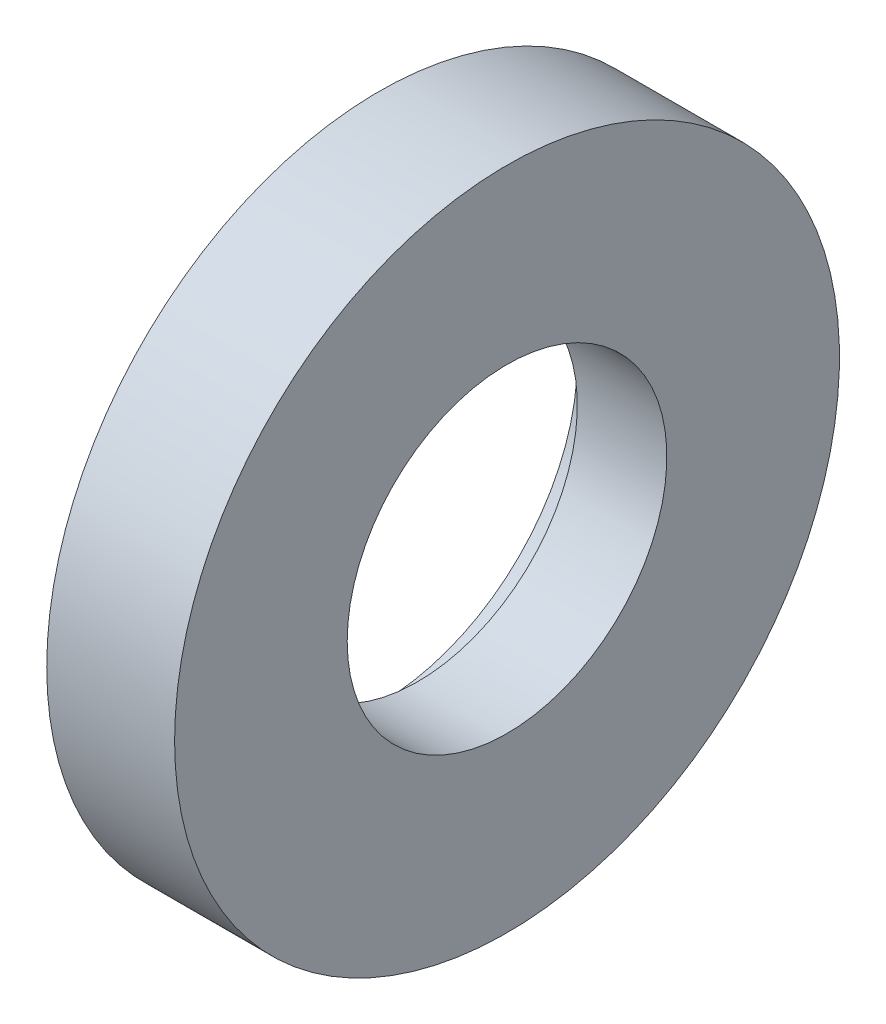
ISO-10303-21;
HEADER;
FILE_DESCRIPTION(('STEP AP214'),'2;1');
FILE_NAME('part.step','',(''),(''),'','','');
FILE_SCHEMA(('AUTOMOTIVE_DESIGN { 1 0 10303 214 1 1 1 1 }'));
ENDSEC;
DATA;
#1=APPLICATION_CONTEXT('core data for automotive mechanical design processes');
#2=APPLICATION_PROTOCOL_DEFINITION('international standard','automotive_design',2000,#1);
#3=PRODUCT_CONTEXT('',#1,'mechanical');
#4=PRODUCT('Part','Part','',(#3));
#5=PRODUCT_RELATED_PRODUCT_CATEGORY('part','',(#4));
#6=PRODUCT_DEFINITION_FORMATION('','',#4);
#7=PRODUCT_DEFINITION_CONTEXT('part definition',#1,'design');
#8=PRODUCT_DEFINITION('design','',#6,#7);
#9=PRODUCT_DEFINITION_SHAPE('','',#8);
#10=(LENGTH_UNIT() NAMED_UNIT(*) SI_UNIT(.MILLI.,.METRE.));
#11=(NAMED_UNIT(*) PLANE_ANGLE_UNIT() SI_UNIT($,.RADIAN.));
#12=(NAMED_UNIT(*) SI_UNIT($,.STERADIAN.) SOLID_ANGLE_UNIT());
#13=UNCERTAINTY_MEASURE_WITH_UNIT(LENGTH_MEASURE(1.E-05),#10,'distance_accuracy_value','');
#14=(GEOMETRIC_REPRESENTATION_CONTEXT(3) GLOBAL_UNCERTAINTY_ASSIGNED_CONTEXT((#13)) GLOBAL_UNIT_ASSIGNED_CONTEXT((#10,
#11,#12)) REPRESENTATION_CONTEXT('',''));
#15=CARTESIAN_POINT('',(0.,0.,0.));
#16=DIRECTION('',(0.,0.,1.));
#17=DIRECTION('',(1.,0.,0.));
#18=AXIS2_PLACEMENT_3D('',#15,#16,#17);
#19=CARTESIAN_POINT('',(-24.149081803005,0.,0.));
#20=DIRECTION('',(-1.,0.,0.));
#21=DIRECTION('',(0.,0.,1.));
#22=AXIS2_PLACEMENT_3D('',#19,#20,#21);
#23=CYLINDRICAL_SURFACE('',#22,15.5);
#24=CARTESIAN_POINT('',(3.,0.,0.));
#25=DIRECTION('',(-1.,0.,0.));
#26=DIRECTION('',(0.,0.,1.));
#27=AXIS2_PLACEMENT_3D('',#24,#25,#26);
#28=CIRCLE('',#27,15.5);
#29=CARTESIAN_POINT('',(3.,0.,15.5));
#30=VERTEX_POINT('',#29);
#31=EDGE_CURVE('E53',#30,#30,#28,.T.);
#32=ORIENTED_EDGE('',*,*,#31,.F.);
#33=EDGE_LOOP('',(#32));
#34=FACE_BOUND('',#33,.T.);
#35=CARTESIAN_POINT('',(0.,0.,0.));
#36=DIRECTION('',(-1.,0.,0.));
#37=DIRECTION('',(0.,0.,1.));
#38=AXIS2_PLACEMENT_3D('',#35,#36,#37);
#39=CIRCLE('',#38,15.5);
#40=CARTESIAN_POINT('',(0.,0.,15.5));
#41=VERTEX_POINT('',#40);
#42=EDGE_CURVE('E10',#41,#41,#39,.T.);
#43=ORIENTED_EDGE('',*,*,#42,.T.);
#44=EDGE_LOOP('',(#43));
#45=FACE_BOUND('',#44,.T.);
#46=ADVANCED_FACE('F31',(#34,#45),#23,.F.);
#47=CARTESIAN_POINT('',(0.,15.5,0.));
#48=DIRECTION('',(1.,0.,0.));
#49=DIRECTION('',(0.,0.,-1.));
#50=AXIS2_PLACEMENT_3D('',#47,#48,#49);
#51=PLANE('',#50);
#52=ORIENTED_EDGE('',*,*,#42,.F.);
#53=EDGE_LOOP('',(#52));
#54=FACE_BOUND('',#53,.T.);
#55=CARTESIAN_POINT('',(0.,0.,0.));
#56=DIRECTION('',(-1.,0.,0.));
#57=DIRECTION('',(0.,0.,1.));
#58=AXIS2_PLACEMENT_3D('',#55,#56,#57);
#59=CIRCLE('',#58,26.);
#60=CARTESIAN_POINT('',(0.,0.,26.));
#61=VERTEX_POINT('',#60);
#62=EDGE_CURVE('E37',#61,#61,#59,.T.);
#63=ORIENTED_EDGE('',*,*,#62,.T.);
#64=EDGE_LOOP('',(#63));
#65=FACE_BOUND('',#64,.T.);
#66=ADVANCED_FACE('F60',(#54,#65),#51,.F.);
#67=CARTESIAN_POINT('',(-24.149081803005,0.,0.));
#68=DIRECTION('',(-1.,0.,0.));
#69=DIRECTION('',(0.,0.,1.));
#70=AXIS2_PLACEMENT_3D('',#67,#68,#69);
#71=CYLINDRICAL_SURFACE('',#70,26.);
#72=ORIENTED_EDGE('',*,*,#62,.F.);
#73=EDGE_LOOP('',(#72));
#74=FACE_BOUND('',#73,.T.);
#75=CARTESIAN_POINT('',(10.,0.,0.));
#76=DIRECTION('',(-1.,0.,0.));
#77=DIRECTION('',(0.,0.,1.));
#78=AXIS2_PLACEMENT_3D('',#75,#76,#77);
#79=CIRCLE('',#78,26.);
#80=CARTESIAN_POINT('',(10.,0.,26.));
#81=VERTEX_POINT('',#80);
#82=EDGE_CURVE('E41',#81,#81,#79,.T.);
#83=ORIENTED_EDGE('',*,*,#82,.T.);
#84=EDGE_LOOP('',(#83));
#85=FACE_BOUND('',#84,.T.);
#86=ADVANCED_FACE('F64',(#74,#85),#71,.T.);
#87=CARTESIAN_POINT('',(10.,26.,0.));
#88=DIRECTION('',(-1.,0.,0.));
#89=DIRECTION('',(0.,0.,1.));
#90=AXIS2_PLACEMENT_3D('',#87,#88,#89);
#91=PLANE('',#90);
#92=ORIENTED_EDGE('',*,*,#82,.F.);
#93=EDGE_LOOP('',(#92));
#94=FACE_BOUND('',#93,.T.);
#95=CARTESIAN_POINT('',(10.,0.,0.));
#96=DIRECTION('',(-1.,0.,0.));
#97=DIRECTION('',(0.,0.,1.));
#98=AXIS2_PLACEMENT_3D('',#95,#96,#97);
#99=CIRCLE('',#98,12.5);
#100=CARTESIAN_POINT('',(10.,0.,12.5));
#101=VERTEX_POINT('',#100);
#102=EDGE_CURVE('E45',#101,#101,#99,.T.);
#103=ORIENTED_EDGE('',*,*,#102,.T.);
#104=EDGE_LOOP('',(#103));
#105=FACE_BOUND('',#104,.T.);
#106=ADVANCED_FACE('F69',(#94,#105),#91,.F.);
#107=CARTESIAN_POINT('',(-24.149081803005,0.,0.));
#108=DIRECTION('',(-1.,0.,0.));
#109=DIRECTION('',(0.,0.,1.));
#110=AXIS2_PLACEMENT_3D('',#107,#108,#109);
#111=CYLINDRICAL_SURFACE('',#110,12.5);
#112=ORIENTED_EDGE('',*,*,#102,.F.);
#113=EDGE_LOOP('',(#112));
#114=FACE_BOUND('',#113,.T.);
#115=CARTESIAN_POINT('',(3.,0.,0.));
#116=DIRECTION('',(-1.,0.,0.));
#117=DIRECTION('',(0.,0.,1.));
#118=AXIS2_PLACEMENT_3D('',#115,#116,#117);
#119=CIRCLE('',#118,12.5);
#120=CARTESIAN_POINT('',(3.,0.,12.5));
#121=VERTEX_POINT('',#120);
#122=EDGE_CURVE('E50',#121,#121,#119,.T.);
#123=ORIENTED_EDGE('',*,*,#122,.T.);
#124=EDGE_LOOP('',(#123));
#125=FACE_BOUND('',#124,.T.);
#126=ADVANCED_FACE('F75',(#114,#125),#111,.F.);
#127=CARTESIAN_POINT('',(3.,12.5,0.));
#128=DIRECTION('',(1.,0.,0.));
#129=DIRECTION('',(0.,0.,-1.));
#130=AXIS2_PLACEMENT_3D('',#127,#128,#129);
#131=PLANE('',#130);
#132=ORIENTED_EDGE('',*,*,#122,.F.);
#133=EDGE_LOOP('',(#132));
#134=FACE_BOUND('',#133,.T.);
#135=ORIENTED_EDGE('',*,*,#31,.T.);
#136=EDGE_LOOP('',(#135));
#137=FACE_BOUND('',#136,.T.);
#138=ADVANCED_FACE('F57',(#134,#137),#131,.F.);
#139=CLOSED_SHELL('',(#46,#66,#86,#106,#126,#138));
#140=MANIFOLD_SOLID_BREP('B2',#139);
#141=ADVANCED_BREP_SHAPE_REPRESENTATION('',(#18,#140),#14);
#142=SHAPE_DEFINITION_REPRESENTATION(#9,#141);
ENDSEC;
END-ISO-10303-21;
